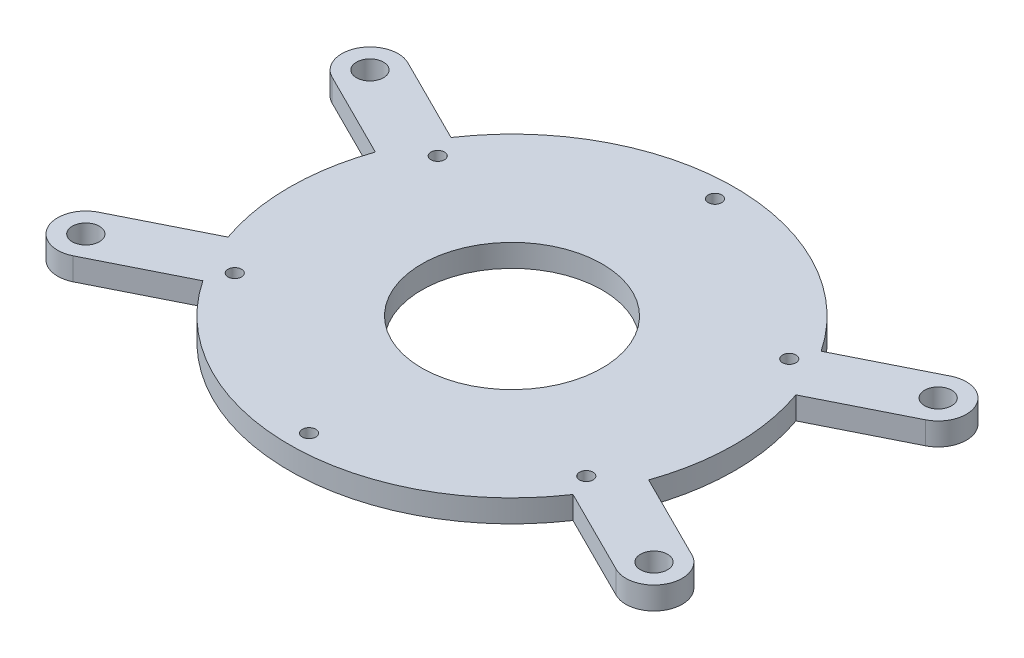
from build123d import *

# Parameters (mm, degrees)
SKETCH_1_R               = 20
EXTRUDE_1_DEPTH          = 5
CUT_EXTRUDE_1_REACH      = 87.2
SKETCH_2_R               = 3
MIRROR_2_COPY_1_REACH    = 87.2
MIRROR_2_COPY_1_SKETCH_R = 3
SKETCH_3_R               = 1.5
CUT_EXTRUDE_2_DEPTH      = 86.199993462
PATTERN_CIRCULAR_1_COUNT = 6


with BuildPart() as part:
    # Sketch 1 → Extrude 1 (new body)
    with BuildSketch(Plane(origin=(0, 0, 0), x_dir=(1, 0, 0), z_dir=(0, 1, 0))):
        with BuildLine():
            Line((46.623322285, 16.328680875), (65.781966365, 25.910071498))
            ThreePointArc((65.781966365, 25.910071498), (68.576327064, 34.295567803), (60.190830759, 37.089928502))
            Line((60.190830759, 37.089928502), (41.03218668, 27.50853788))
            ThreePointArc((41.03218668, 27.50853788), (0, 49.4), (-41.03218668, 27.50853788))
            Line((-41.03218668, 27.50853788), (-60.190830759, 37.089928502))
            ThreePointArc((-60.190830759, 37.089928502), (-68.576327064, 34.295567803), (-65.781966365, 25.910071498))
            Line((-65.781966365, 25.910071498), (-46.623322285, 16.328680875))
            ThreePointArc((-46.623322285, 16.328680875), (-49.4, 0), (-46.623322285, -16.328680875))
            Line((-46.623322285, -16.328680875), (-65.781966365, -25.910071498))
            ThreePointArc((-65.781966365, -25.910071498), (-68.576327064, -34.295567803), (-60.190830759, -37.089928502))
            Line((-60.190830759, -37.089928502), (-41.03218668, -27.50853788))
            ThreePointArc((-41.03218668, -27.50853788), (0, -49.4), (41.03218668, -27.50853788))
            Line((41.03218668, -27.50853788), (60.190830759, -37.089928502))
            ThreePointArc((60.190830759, -37.089928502), (68.576327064, -34.295567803), (65.781966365, -25.910071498))
            Line((65.781966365, -25.910071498), (46.623322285, -16.328680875))
            ThreePointArc((46.623322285, -16.328680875), (49.4, 0), (46.623322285, 16.328680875))
        make_face()
        with Locations(Location((0, 0, 0), (0, 0, 270))):
            Circle(SKETCH_1_R, mode=Mode.SUBTRACT)
    extrude(amount=EXTRUDE_1_DEPTH)

    # Sketch 2 → Cut-Extrude 1 (cut, up to next)
    with BuildSketch(Plane(origin=(0, 5, 0), x_dir=(1, 0, 0), z_dir=(0, 1, 0)), mode=Mode.PRIVATE) as cut_extrude_1_sk1:
        with Locations(Location((-62.986398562, 31.5, 0), (0, 0, 270))):
            Circle(SKETCH_2_R)
    cut_extrude_1_tool1 = extrude(cut_extrude_1_sk1.sketch, amount=-CUT_EXTRUDE_1_REACH, mode=Mode.PRIVATE) & part.part
    cut_extrude_1 = cut_extrude_1_tool1.solids().sort_by_distance((-62.986399, 5, -31.5))[0]
    add(cut_extrude_1, mode=Mode.SUBTRACT)

    # Mirror 1: Cut-Extrude 1 across plane
    add(cut_extrude_1.mirror(Plane.XY), mode=Mode.SUBTRACT)

    # Mirror 2: Cut-Extrude 1 across plane
    add(cut_extrude_1.mirror(Plane(origin=(0, 0, 0), x_dir=(0, 0, 1), z_dir=(1, 0, 0))), mode=Mode.SUBTRACT)

    # Mirror 2 copy 1 sketch → Mirror 2 copy 1 (cut, up to next)
    with BuildSketch(Plane(origin=(0, 5, 0), x_dir=(-1, 0, 0), z_dir=(0, 1, 0)), mode=Mode.PRIVATE) as mirror_2_copy_1_sk1:
        with Locations(Location((-62.986398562, 31.5, 0), (0, 0, 270))):
            Circle(MIRROR_2_COPY_1_SKETCH_R)
    mirror_2_copy_1_tool1 = extrude(mirror_2_copy_1_sk1.sketch, amount=-MIRROR_2_COPY_1_REACH, mode=Mode.PRIVATE) & part.part
    add(mirror_2_copy_1_tool1.solids().sort_by_distance((62.986399, 5, 31.5))[0], mode=Mode.SUBTRACT)

    # Sketch 3 → Cut-Extrude 2 (cut, through all)
    with BuildSketch(Plane.XZ):
        with Locations(Location((0, 45, 0), (0, 0, 270))):
            Circle(SKETCH_3_R)
    cut_extrude_2 = extrude(amount=-CUT_EXTRUDE_2_DEPTH, mode=Mode.SUBTRACT)

    # Pattern Circular 1: Cut-Extrude 2 ×6 about axis
    pattern_circular_1_axis = Axis((0, 0, 0), (0, 1, 0))
    for i in range(1, PATTERN_CIRCULAR_1_COUNT):
        add(cut_extrude_2.rotate(pattern_circular_1_axis, i * 360 / PATTERN_CIRCULAR_1_COUNT), mode=Mode.SUBTRACT)


solid = part.part
